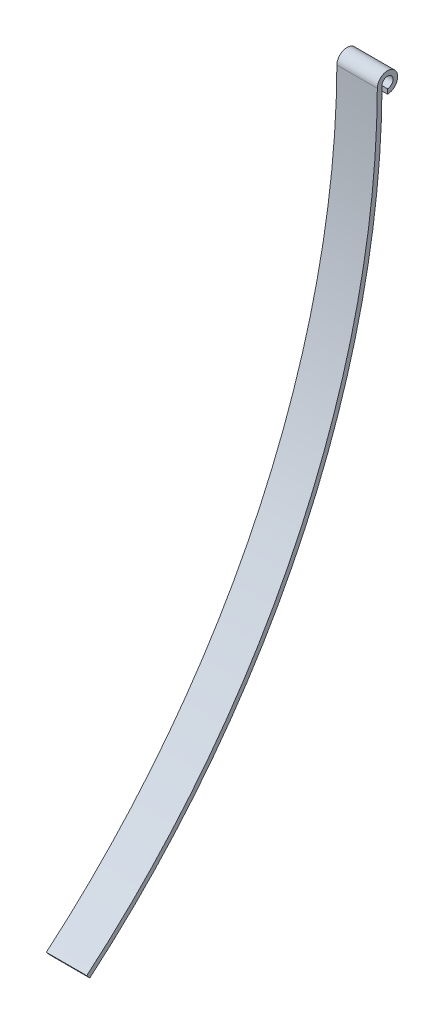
ISO-10303-21;
HEADER;
FILE_DESCRIPTION(('STEP AP214'),'2;1');
FILE_NAME('part.step','',(''),(''),'','','');
FILE_SCHEMA(('AUTOMOTIVE_DESIGN { 1 0 10303 214 1 1 1 1 }'));
ENDSEC;
DATA;
#1=APPLICATION_CONTEXT('core data for automotive mechanical design processes');
#2=APPLICATION_PROTOCOL_DEFINITION('international standard','automotive_design',2000,#1);
#3=PRODUCT_CONTEXT('',#1,'mechanical');
#4=PRODUCT('Part','Part','',(#3));
#5=PRODUCT_RELATED_PRODUCT_CATEGORY('part','',(#4));
#6=PRODUCT_DEFINITION_FORMATION('','',#4);
#7=PRODUCT_DEFINITION_CONTEXT('part definition',#1,'design');
#8=PRODUCT_DEFINITION('design','',#6,#7);
#9=PRODUCT_DEFINITION_SHAPE('','',#8);
#10=(LENGTH_UNIT() NAMED_UNIT(*) SI_UNIT(.MILLI.,.METRE.));
#11=(NAMED_UNIT(*) PLANE_ANGLE_UNIT() SI_UNIT($,.RADIAN.));
#12=(NAMED_UNIT(*) SI_UNIT($,.STERADIAN.) SOLID_ANGLE_UNIT());
#13=UNCERTAINTY_MEASURE_WITH_UNIT(LENGTH_MEASURE(1.E-05),#10,'distance_accuracy_value','');
#14=(GEOMETRIC_REPRESENTATION_CONTEXT(3) GLOBAL_UNCERTAINTY_ASSIGNED_CONTEXT((#13)) GLOBAL_UNIT_ASSIGNED_CONTEXT((#10,
#11,#12)) REPRESENTATION_CONTEXT('',''));
#15=CARTESIAN_POINT('',(0.,0.,0.));
#16=DIRECTION('',(0.,0.,1.));
#17=DIRECTION('',(1.,0.,0.));
#18=AXIS2_PLACEMENT_3D('',#15,#16,#17);
#19=CARTESIAN_POINT('',(0.,8.36637031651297,529.496669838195));
#20=DIRECTION('',(-1.,0.,0.));
#21=DIRECTION('',(0.,0.,1.));
#22=AXIS2_PLACEMENT_3D('',#19,#20,#21);
#23=CYLINDRICAL_SURFACE('',#22,525.999981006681);
#24=DIRECTION('',(-1.,0.,0.));
#25=VECTOR('',#24,1.);
#26=CARTESIAN_POINT('',(0.,6.49999999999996,3.5));
#27=LINE('',#26,#25);
#28=CARTESIAN_POINT('',(25.8,6.49999999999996,3.5));
#29=VERTEX_POINT('',#28);
#30=CARTESIAN_POINT('',(0.,6.49999999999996,3.5));
#31=VERTEX_POINT('',#30);
#32=EDGE_CURVE('E98',#29,#31,#27,.T.);
#33=ORIENTED_EDGE('',*,*,#32,.F.);
#34=CARTESIAN_POINT('',(25.8,8.36637031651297,529.496669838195));
#35=DIRECTION('',(-1.,0.,0.));
#36=DIRECTION('',(0.,0.,1.));
#37=AXIS2_PLACEMENT_3D('',#34,#35,#36);
#38=CIRCLE('',#37,525.999981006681);
#39=CARTESIAN_POINT('',(25.8,-393.356954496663,189.946452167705));
#40=VERTEX_POINT('',#39);
#41=EDGE_CURVE('E40',#29,#40,#38,.T.);
#42=ORIENTED_EDGE('',*,*,#41,.T.);
#43=DIRECTION('',(-1.,0.,0.));
#44=VECTOR('',#43,1.);
#45=CARTESIAN_POINT('',(0.,-393.356954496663,189.946452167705));
#46=LINE('',#45,#44);
#47=CARTESIAN_POINT('',(0.,-393.356954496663,189.946452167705));
#48=VERTEX_POINT('',#47);
#49=EDGE_CURVE('E47',#40,#48,#46,.T.);
#50=ORIENTED_EDGE('',*,*,#49,.T.);
#51=CARTESIAN_POINT('',(0.,8.36637031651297,529.496669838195));
#52=DIRECTION('',(-1.,0.,0.));
#53=DIRECTION('',(0.,0.,1.));
#54=AXIS2_PLACEMENT_3D('',#51,#52,#53);
#55=CIRCLE('',#54,525.999981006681);
#56=EDGE_CURVE('E11',#31,#48,#55,.T.);
#57=ORIENTED_EDGE('',*,*,#56,.F.);
#58=EDGE_LOOP('',(#33,#42,#50,#57));
#59=FACE_BOUND('',#58,.T.);
#60=ADVANCED_FACE('F32',(#59),#23,.T.);
#61=CARTESIAN_POINT('',(0.,8.36637031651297,529.496669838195));
#62=DIRECTION('',(-1.,0.,0.));
#63=DIRECTION('',(0.,0.,1.));
#64=AXIS2_PLACEMENT_3D('',#61,#62,#63);
#65=CYLINDRICAL_SURFACE('',#64,523.);
#66=DIRECTION('',(1.,0.,0.));
#67=VECTOR('',#66,1.);
#68=CARTESIAN_POINT('',(0.,6.49999999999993,6.5));
#69=LINE('',#68,#67);
#70=CARTESIAN_POINT('',(0.,6.49999999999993,6.5));
#71=VERTEX_POINT('',#70);
#72=CARTESIAN_POINT('',(25.8,6.49999999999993,6.5));
#73=VERTEX_POINT('',#72);
#74=EDGE_CURVE('E117',#71,#73,#69,.T.);
#75=ORIENTED_EDGE('',*,*,#74,.F.);
#76=CARTESIAN_POINT('',(0.,8.36637031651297,529.496669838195));
#77=DIRECTION('',(-1.,0.,0.));
#78=DIRECTION('',(0.,0.,1.));
#79=AXIS2_PLACEMENT_3D('',#76,#77,#78);
#80=CIRCLE('',#79,523.);
#81=CARTESIAN_POINT('',(0.,-391.072642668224,191.891167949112));
#82=VERTEX_POINT('',#81);
#83=EDGE_CURVE('E93',#71,#82,#80,.T.);
#84=ORIENTED_EDGE('',*,*,#83,.T.);
#85=DIRECTION('',(1.,0.,0.));
#86=VECTOR('',#85,1.);
#87=CARTESIAN_POINT('',(0.,-391.072642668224,191.891167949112));
#88=LINE('',#87,#86);
#89=CARTESIAN_POINT('',(25.8,-391.072642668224,191.891167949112));
#90=VERTEX_POINT('',#89);
#91=EDGE_CURVE('E128',#82,#90,#88,.T.);
#92=ORIENTED_EDGE('',*,*,#91,.T.);
#93=CARTESIAN_POINT('',(25.8,8.36637031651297,529.496669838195));
#94=DIRECTION('',(-1.,0.,0.));
#95=DIRECTION('',(0.,0.,1.));
#96=AXIS2_PLACEMENT_3D('',#93,#94,#95);
#97=CIRCLE('',#96,523.);
#98=EDGE_CURVE('E133',#73,#90,#97,.T.);
#99=ORIENTED_EDGE('',*,*,#98,.F.);
#100=EDGE_LOOP('',(#75,#84,#92,#99));
#101=FACE_BOUND('',#100,.T.);
#102=ADVANCED_FACE('F143',(#101),#65,.F.);
#103=CARTESIAN_POINT('',(0.,6.49999999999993,6.5));
#104=DIRECTION('',(-1.,0.,0.));
#105=DIRECTION('',(0.,0.,1.));
#106=AXIS2_PLACEMENT_3D('',#103,#104,#105);
#107=PLANE('',#106);
#108=CARTESIAN_POINT('',(0.,6.5,0.));
#109=DIRECTION('',(-1.,0.,0.));
#110=DIRECTION('',(0.,0.,1.));
#111=AXIS2_PLACEMENT_3D('',#108,#109,#110);
#112=CIRCLE('',#111,3.5);
#113=CARTESIAN_POINT('',(0.,3.,0.));
#114=VERTEX_POINT('',#113);
#115=EDGE_CURVE('E124',#31,#114,#112,.T.);
#116=ORIENTED_EDGE('',*,*,#115,.F.);
#117=ORIENTED_EDGE('',*,*,#56,.T.);
#118=DIRECTION('',(0.,0.761437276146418,0.648238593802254));
#119=VECTOR('',#118,1.);
#120=CARTESIAN_POINT('',(0.,-391.072642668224,191.891167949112));
#121=LINE('',#120,#119);
#122=EDGE_CURVE('E126',#48,#82,#121,.T.);
#123=ORIENTED_EDGE('',*,*,#122,.T.);
#124=ORIENTED_EDGE('',*,*,#83,.F.);
#125=CARTESIAN_POINT('',(0.,6.5,0.));
#126=DIRECTION('',(-1.,0.,0.));
#127=DIRECTION('',(0.,0.,1.));
#128=AXIS2_PLACEMENT_3D('',#125,#126,#127);
#129=CIRCLE('',#128,6.5);
#130=CARTESIAN_POINT('',(0.,0.,0.));
#131=VERTEX_POINT('',#130);
#132=EDGE_CURVE('E86',#71,#131,#129,.T.);
#133=ORIENTED_EDGE('',*,*,#132,.T.);
#134=DIRECTION('',(0.,-1.,0.));
#135=VECTOR('',#134,1.);
#136=CARTESIAN_POINT('',(0.,0.,0.));
#137=LINE('',#136,#135);
#138=EDGE_CURVE('E91',#114,#131,#137,.T.);
#139=ORIENTED_EDGE('',*,*,#138,.F.);
#140=EDGE_LOOP('',(#116,#117,#123,#124,#133,#139));
#141=FACE_BOUND('',#140,.T.);
#142=ADVANCED_FACE('F89',(#141),#107,.T.);
#143=CARTESIAN_POINT('',(0.,6.5,0.));
#144=DIRECTION('',(-1.,0.,0.));
#145=DIRECTION('',(0.,0.,1.));
#146=AXIS2_PLACEMENT_3D('',#143,#144,#145);
#147=CYLINDRICAL_SURFACE('',#146,3.5);
#148=CARTESIAN_POINT('',(25.8,6.5,0.));
#149=DIRECTION('',(-1.,0.,0.));
#150=DIRECTION('',(0.,0.,1.));
#151=AXIS2_PLACEMENT_3D('',#148,#149,#150);
#152=CIRCLE('',#151,3.5);
#153=CARTESIAN_POINT('',(25.8,3.,0.));
#154=VERTEX_POINT('',#153);
#155=EDGE_CURVE('E122',#29,#154,#152,.T.);
#156=ORIENTED_EDGE('',*,*,#155,.F.);
#157=ORIENTED_EDGE('',*,*,#32,.T.);
#158=ORIENTED_EDGE('',*,*,#115,.T.);
#159=DIRECTION('',(-1.,0.,0.));
#160=VECTOR('',#159,1.);
#161=CARTESIAN_POINT('',(0.,3.,0.));
#162=LINE('',#161,#160);
#163=EDGE_CURVE('E112',#154,#114,#162,.T.);
#164=ORIENTED_EDGE('',*,*,#163,.F.);
#165=EDGE_LOOP('',(#156,#157,#158,#164));
#166=FACE_BOUND('',#165,.T.);
#167=ADVANCED_FACE('F138',(#166),#147,.F.);
#168=CARTESIAN_POINT('',(25.8,6.49999999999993,6.5));
#169=DIRECTION('',(1.,0.,0.));
#170=DIRECTION('',(0.,0.,-1.));
#171=AXIS2_PLACEMENT_3D('',#168,#169,#170);
#172=PLANE('',#171);
#173=CARTESIAN_POINT('',(25.8,6.5,0.));
#174=DIRECTION('',(-1.,0.,0.));
#175=DIRECTION('',(0.,0.,1.));
#176=AXIS2_PLACEMENT_3D('',#173,#174,#175);
#177=CIRCLE('',#176,6.5);
#178=CARTESIAN_POINT('',(25.8,0.,0.));
#179=VERTEX_POINT('',#178);
#180=EDGE_CURVE('E97',#73,#179,#177,.T.);
#181=ORIENTED_EDGE('',*,*,#180,.F.);
#182=ORIENTED_EDGE('',*,*,#98,.T.);
#183=DIRECTION('',(0.,-0.761437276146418,-0.648238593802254));
#184=VECTOR('',#183,1.);
#185=CARTESIAN_POINT('',(25.8,-391.072642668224,191.891167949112));
#186=LINE('',#185,#184);
#187=EDGE_CURVE('E55',#90,#40,#186,.T.);
#188=ORIENTED_EDGE('',*,*,#187,.T.);
#189=ORIENTED_EDGE('',*,*,#41,.F.);
#190=ORIENTED_EDGE('',*,*,#155,.T.);
#191=DIRECTION('',(0.,1.,0.));
#192=VECTOR('',#191,1.);
#193=CARTESIAN_POINT('',(25.8,0.,0.));
#194=LINE('',#193,#192);
#195=EDGE_CURVE('E107',#179,#154,#194,.T.);
#196=ORIENTED_EDGE('',*,*,#195,.F.);
#197=EDGE_LOOP('',(#181,#182,#188,#189,#190,#196));
#198=FACE_BOUND('',#197,.T.);
#199=ADVANCED_FACE('F136',(#198),#172,.T.);
#200=CARTESIAN_POINT('',(0.,6.5,0.));
#201=DIRECTION('',(-1.,0.,0.));
#202=DIRECTION('',(0.,0.,1.));
#203=AXIS2_PLACEMENT_3D('',#200,#201,#202);
#204=CYLINDRICAL_SURFACE('',#203,6.5);
#205=ORIENTED_EDGE('',*,*,#74,.T.);
#206=ORIENTED_EDGE('',*,*,#180,.T.);
#207=DIRECTION('',(1.,0.,0.));
#208=VECTOR('',#207,1.);
#209=CARTESIAN_POINT('',(0.,0.,0.));
#210=LINE('',#209,#208);
#211=EDGE_CURVE('E101',#131,#179,#210,.T.);
#212=ORIENTED_EDGE('',*,*,#211,.F.);
#213=ORIENTED_EDGE('',*,*,#132,.F.);
#214=EDGE_LOOP('',(#205,#206,#212,#213));
#215=FACE_BOUND('',#214,.T.);
#216=ADVANCED_FACE('F102',(#215),#204,.T.);
#217=CARTESIAN_POINT('',(0.,-393.356954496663,189.946452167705));
#218=DIRECTION('',(0.,-0.648238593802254,0.761437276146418));
#219=DIRECTION('',(-1.,0.,0.));
#220=AXIS2_PLACEMENT_3D('',#217,#218,#219);
#221=PLANE('',#220);
#222=ORIENTED_EDGE('',*,*,#122,.F.);
#223=ORIENTED_EDGE('',*,*,#49,.F.);
#224=ORIENTED_EDGE('',*,*,#187,.F.);
#225=ORIENTED_EDGE('',*,*,#91,.F.);
#226=EDGE_LOOP('',(#222,#223,#224,#225));
#227=FACE_BOUND('',#226,.T.);
#228=ADVANCED_FACE('F141',(#227),#221,.T.);
#229=CARTESIAN_POINT('',(0.,3.,0.));
#230=DIRECTION('',(0.,0.,-1.));
#231=DIRECTION('',(-1.,0.,0.));
#232=AXIS2_PLACEMENT_3D('',#229,#230,#231);
#233=PLANE('',#232);
#234=ORIENTED_EDGE('',*,*,#138,.T.);
#235=ORIENTED_EDGE('',*,*,#211,.T.);
#236=ORIENTED_EDGE('',*,*,#195,.T.);
#237=ORIENTED_EDGE('',*,*,#163,.T.);
#238=EDGE_LOOP('',(#234,#235,#236,#237));
#239=FACE_BOUND('',#238,.T.);
#240=ADVANCED_FACE('F110',(#239),#233,.F.);
#241=CLOSED_SHELL('',(#60,#102,#142,#167,#199,#216,#228,#240));
#242=MANIFOLD_SOLID_BREP('B2',#241);
#243=ADVANCED_BREP_SHAPE_REPRESENTATION('',(#18,#242),#14);
#244=SHAPE_DEFINITION_REPRESENTATION(#9,#243);
ENDSEC;
END-ISO-10303-21;
